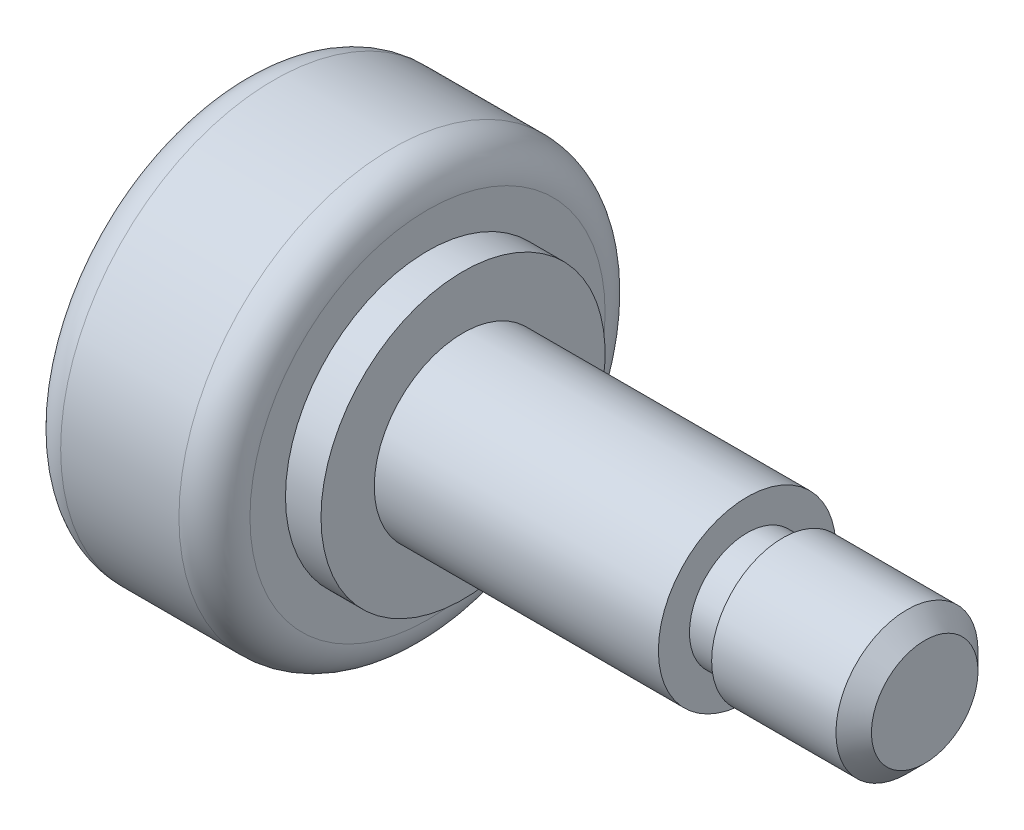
ISO-10303-21;
HEADER;
FILE_DESCRIPTION(('STEP AP214'),'2;1');
FILE_NAME('part.step','',(''),(''),'','','');
FILE_SCHEMA(('AUTOMOTIVE_DESIGN { 1 0 10303 214 1 1 1 1 }'));
ENDSEC;
DATA;
#1=APPLICATION_CONTEXT('core data for automotive mechanical design processes');
#2=APPLICATION_PROTOCOL_DEFINITION('international standard','automotive_design',2000,#1);
#3=PRODUCT_CONTEXT('',#1,'mechanical');
#4=PRODUCT('Part','Part','',(#3));
#5=PRODUCT_RELATED_PRODUCT_CATEGORY('part','',(#4));
#6=PRODUCT_DEFINITION_FORMATION('','',#4);
#7=PRODUCT_DEFINITION_CONTEXT('part definition',#1,'design');
#8=PRODUCT_DEFINITION('design','',#6,#7);
#9=PRODUCT_DEFINITION_SHAPE('','',#8);
#10=(LENGTH_UNIT() NAMED_UNIT(*) SI_UNIT(.MILLI.,.METRE.));
#11=(NAMED_UNIT(*) PLANE_ANGLE_UNIT() SI_UNIT($,.RADIAN.));
#12=(NAMED_UNIT(*) SI_UNIT($,.STERADIAN.) SOLID_ANGLE_UNIT());
#13=UNCERTAINTY_MEASURE_WITH_UNIT(LENGTH_MEASURE(1.E-05),#10,'distance_accuracy_value','');
#14=(GEOMETRIC_REPRESENTATION_CONTEXT(3) GLOBAL_UNCERTAINTY_ASSIGNED_CONTEXT((#13)) GLOBAL_UNIT_ASSIGNED_CONTEXT((#10,
#11,#12)) REPRESENTATION_CONTEXT('',''));
#15=CARTESIAN_POINT('',(0.,0.,0.));
#16=DIRECTION('',(0.,0.,1.));
#17=DIRECTION('',(1.,0.,0.));
#18=AXIS2_PLACEMENT_3D('',#15,#16,#17);
#19=CARTESIAN_POINT('',(40.,0.,0.));
#20=DIRECTION('',(-1.,0.,0.));
#21=DIRECTION('',(0.,1.,0.));
#22=AXIS2_PLACEMENT_3D('',#19,#20,#21);
#23=SPHERICAL_SURFACE('',#22,40.);
#24=CARTESIAN_POINT('',(1.4098888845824,0.,0.));
#25=DIRECTION('',(-1.,0.,0.));
#26=DIRECTION('',(0.,0.,1.));
#27=AXIS2_PLACEMENT_3D('',#24,#25,#26);
#28=CIRCLE('',#27,10.5263157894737);
#29=CARTESIAN_POINT('',(1.4098888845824,0.,10.5263157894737));
#30=VERTEX_POINT('',#29);
#31=EDGE_CURVE('E91',#30,#30,#28,.T.);
#32=ORIENTED_EDGE('',*,*,#31,.T.);
#33=EDGE_LOOP('',(#32));
#34=FACE_BOUND('',#33,.T.);
#35=ADVANCED_FACE('F46',(#34),#23,.T.);
#36=CARTESIAN_POINT('',(40.,0.,0.));
#37=DIRECTION('',(1.,0.,0.));
#38=DIRECTION('',(0.,0.,-1.));
#39=AXIS2_PLACEMENT_3D('',#36,#37,#38);
#40=PLANE('',#39);
#41=CARTESIAN_POINT('',(40.,0.,0.));
#42=DIRECTION('',(1.,0.,0.));
#43=DIRECTION('',(0.,0.,-1.));
#44=AXIS2_PLACEMENT_3D('',#41,#42,#43);
#45=CIRCLE('',#44,3.);
#46=CARTESIAN_POINT('',(40.,0.,-3.));
#47=VERTEX_POINT('',#46);
#48=EDGE_CURVE('E10',#47,#47,#45,.T.);
#49=ORIENTED_EDGE('',*,*,#48,.T.);
#50=EDGE_LOOP('',(#49));
#51=FACE_BOUND('',#50,.T.);
#52=ADVANCED_FACE('F111',(#51),#40,.T.);
#53=CARTESIAN_POINT('',(0.,0.,0.));
#54=DIRECTION('',(-1.,0.,0.));
#55=DIRECTION('',(0.,0.,1.));
#56=AXIS2_PLACEMENT_3D('',#53,#54,#55);
#57=CYLINDRICAL_SURFACE('',#56,4.);
#58=CARTESIAN_POINT('',(39.,0.,0.));
#59=DIRECTION('',(1.,0.,0.));
#60=DIRECTION('',(0.,0.,-1.));
#61=AXIS2_PLACEMENT_3D('',#58,#59,#60);
#62=CIRCLE('',#61,4.);
#63=CARTESIAN_POINT('',(39.,0.,-4.));
#64=VERTEX_POINT('',#63);
#65=EDGE_CURVE('E54',#64,#64,#62,.F.);
#66=ORIENTED_EDGE('',*,*,#65,.T.);
#67=EDGE_LOOP('',(#66));
#68=FACE_BOUND('',#67,.T.);
#69=CARTESIAN_POINT('',(32.,0.,0.));
#70=DIRECTION('',(-1.,0.,0.));
#71=DIRECTION('',(0.,0.,1.));
#72=AXIS2_PLACEMENT_3D('',#69,#70,#71);
#73=CIRCLE('',#72,4.);
#74=CARTESIAN_POINT('',(32.,0.,4.));
#75=VERTEX_POINT('',#74);
#76=EDGE_CURVE('E58',#75,#75,#73,.T.);
#77=ORIENTED_EDGE('',*,*,#76,.F.);
#78=EDGE_LOOP('',(#77));
#79=FACE_BOUND('',#78,.T.);
#80=ADVANCED_FACE('F115',(#68,#79),#57,.T.);
#81=CARTESIAN_POINT('',(32.,0.,0.));
#82=DIRECTION('',(1.,0.,0.));
#83=DIRECTION('',(0.,0.,-1.));
#84=AXIS2_PLACEMENT_3D('',#81,#82,#83);
#85=PLANE('',#84);
#86=CARTESIAN_POINT('',(32.,0.,0.));
#87=DIRECTION('',(-1.,0.,0.));
#88=DIRECTION('',(0.,0.,1.));
#89=AXIS2_PLACEMENT_3D('',#86,#87,#88);
#90=CIRCLE('',#89,3.25);
#91=CARTESIAN_POINT('',(32.,0.,3.25));
#92=VERTEX_POINT('',#91);
#93=EDGE_CURVE('E62',#92,#92,#90,.T.);
#94=ORIENTED_EDGE('',*,*,#93,.F.);
#95=EDGE_LOOP('',(#94));
#96=FACE_BOUND('',#95,.T.);
#97=ORIENTED_EDGE('',*,*,#76,.T.);
#98=EDGE_LOOP('',(#97));
#99=FACE_BOUND('',#98,.T.);
#100=ADVANCED_FACE('F120',(#96,#99),#85,.F.);
#101=CARTESIAN_POINT('',(0.,0.,0.));
#102=DIRECTION('',(-1.,0.,0.));
#103=DIRECTION('',(0.,0.,1.));
#104=AXIS2_PLACEMENT_3D('',#101,#102,#103);
#105=CYLINDRICAL_SURFACE('',#104,3.25);
#106=ORIENTED_EDGE('',*,*,#93,.T.);
#107=EDGE_LOOP('',(#106));
#108=FACE_BOUND('',#107,.T.);
#109=CARTESIAN_POINT('',(30.,0.,0.));
#110=DIRECTION('',(-1.,0.,0.));
#111=DIRECTION('',(0.,0.,1.));
#112=AXIS2_PLACEMENT_3D('',#109,#110,#111);
#113=CIRCLE('',#112,3.25);
#114=CARTESIAN_POINT('',(30.,0.,3.25));
#115=VERTEX_POINT('',#114);
#116=EDGE_CURVE('E67',#115,#115,#113,.T.);
#117=ORIENTED_EDGE('',*,*,#116,.F.);
#118=EDGE_LOOP('',(#117));
#119=FACE_BOUND('',#118,.T.);
#120=ADVANCED_FACE('F122',(#108,#119),#105,.T.);
#121=CARTESIAN_POINT('',(30.,0.,0.));
#122=DIRECTION('',(1.,0.,0.));
#123=DIRECTION('',(0.,0.,-1.));
#124=AXIS2_PLACEMENT_3D('',#121,#122,#123);
#125=PLANE('',#124);
#126=ORIENTED_EDGE('',*,*,#116,.T.);
#127=EDGE_LOOP('',(#126));
#128=FACE_BOUND('',#127,.T.);
#129=CARTESIAN_POINT('',(30.,0.,0.));
#130=DIRECTION('',(-1.,0.,0.));
#131=DIRECTION('',(0.,0.,1.));
#132=AXIS2_PLACEMENT_3D('',#129,#130,#131);
#133=CIRCLE('',#132,5.);
#134=CARTESIAN_POINT('',(30.,0.,5.));
#135=VERTEX_POINT('',#134);
#136=EDGE_CURVE('E70',#135,#135,#133,.T.);
#137=ORIENTED_EDGE('',*,*,#136,.F.);
#138=EDGE_LOOP('',(#137));
#139=FACE_BOUND('',#138,.T.);
#140=ADVANCED_FACE('F126',(#128,#139),#125,.T.);
#141=CARTESIAN_POINT('',(0.,0.,0.));
#142=DIRECTION('',(-1.,0.,0.));
#143=DIRECTION('',(0.,0.,1.));
#144=AXIS2_PLACEMENT_3D('',#141,#142,#143);
#145=CYLINDRICAL_SURFACE('',#144,5.);
#146=ORIENTED_EDGE('',*,*,#136,.T.);
#147=EDGE_LOOP('',(#146));
#148=FACE_BOUND('',#147,.T.);
#149=CARTESIAN_POINT('',(14.,0.,0.));
#150=DIRECTION('',(-1.,0.,0.));
#151=DIRECTION('',(0.,0.,1.));
#152=AXIS2_PLACEMENT_3D('',#149,#150,#151);
#153=CIRCLE('',#152,5.);
#154=CARTESIAN_POINT('',(14.,0.,5.));
#155=VERTEX_POINT('',#154);
#156=EDGE_CURVE('E73',#155,#155,#153,.T.);
#157=ORIENTED_EDGE('',*,*,#156,.F.);
#158=EDGE_LOOP('',(#157));
#159=FACE_BOUND('',#158,.T.);
#160=ADVANCED_FACE('F130',(#148,#159),#145,.T.);
#161=CARTESIAN_POINT('',(14.,0.,0.));
#162=DIRECTION('',(1.,0.,0.));
#163=DIRECTION('',(0.,0.,-1.));
#164=AXIS2_PLACEMENT_3D('',#161,#162,#163);
#165=PLANE('',#164);
#166=ORIENTED_EDGE('',*,*,#156,.T.);
#167=EDGE_LOOP('',(#166));
#168=FACE_BOUND('',#167,.T.);
#169=CARTESIAN_POINT('',(14.,0.,0.));
#170=DIRECTION('',(-1.,0.,0.));
#171=DIRECTION('',(0.,0.,1.));
#172=AXIS2_PLACEMENT_3D('',#169,#170,#171);
#173=CIRCLE('',#172,8.);
#174=CARTESIAN_POINT('',(14.,0.,8.));
#175=VERTEX_POINT('',#174);
#176=EDGE_CURVE('E76',#175,#175,#173,.T.);
#177=ORIENTED_EDGE('',*,*,#176,.F.);
#178=EDGE_LOOP('',(#177));
#179=FACE_BOUND('',#178,.T.);
#180=ADVANCED_FACE('F134',(#168,#179),#165,.T.);
#181=CARTESIAN_POINT('',(0.,0.,0.));
#182=DIRECTION('',(-1.,0.,0.));
#183=DIRECTION('',(0.,0.,1.));
#184=AXIS2_PLACEMENT_3D('',#181,#182,#183);
#185=CYLINDRICAL_SURFACE('',#184,8.);
#186=CARTESIAN_POINT('',(12.,0.,0.));
#187=DIRECTION('',(-1.,0.,0.));
#188=DIRECTION('',(0.,0.,1.));
#189=AXIS2_PLACEMENT_3D('',#186,#187,#188);
#190=CIRCLE('',#189,8.);
#191=CARTESIAN_POINT('',(12.,0.,8.));
#192=VERTEX_POINT('',#191);
#193=EDGE_CURVE('E79',#192,#192,#190,.T.);
#194=ORIENTED_EDGE('',*,*,#193,.F.);
#195=EDGE_LOOP('',(#194));
#196=FACE_BOUND('',#195,.T.);
#197=ORIENTED_EDGE('',*,*,#176,.T.);
#198=EDGE_LOOP('',(#197));
#199=FACE_BOUND('',#198,.T.);
#200=ADVANCED_FACE('F138',(#196,#199),#185,.T.);
#201=CARTESIAN_POINT('',(12.,0.,0.));
#202=DIRECTION('',(1.,0.,0.));
#203=DIRECTION('',(0.,0.,-1.));
#204=AXIS2_PLACEMENT_3D('',#201,#202,#203);
#205=PLANE('',#204);
#206=ORIENTED_EDGE('',*,*,#193,.T.);
#207=EDGE_LOOP('',(#206));
#208=FACE_BOUND('',#207,.T.);
#209=CARTESIAN_POINT('',(12.,0.,0.));
#210=DIRECTION('',(-1.,0.,0.));
#211=DIRECTION('',(0.,0.,1.));
#212=AXIS2_PLACEMENT_3D('',#209,#210,#211);
#213=CIRCLE('',#212,9.99999999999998);
#214=CARTESIAN_POINT('',(12.,0.,9.99999999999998));
#215=VERTEX_POINT('',#214);
#216=EDGE_CURVE('E82',#215,#215,#213,.T.);
#217=ORIENTED_EDGE('',*,*,#216,.F.);
#218=EDGE_LOOP('',(#217));
#219=FACE_BOUND('',#218,.T.);
#220=ADVANCED_FACE('F142',(#208,#219),#205,.T.);
#221=CARTESIAN_POINT('',(10.,0.,0.));
#222=DIRECTION('',(-1.,0.,0.));
#223=DIRECTION('',(0.,0.,1.));
#224=AXIS2_PLACEMENT_3D('',#221,#222,#223);
#225=TOROIDAL_SURFACE('',#224,9.99999999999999,2.);
#226=CARTESIAN_POINT('',(9.99999999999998,0.,0.));
#227=DIRECTION('',(-1.,0.,0.));
#228=DIRECTION('',(0.,0.,1.));
#229=AXIS2_PLACEMENT_3D('',#226,#227,#228);
#230=CIRCLE('',#229,12.);
#231=CARTESIAN_POINT('',(9.99999999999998,0.,12.));
#232=VERTEX_POINT('',#231);
#233=EDGE_CURVE('E85',#232,#232,#230,.T.);
#234=ORIENTED_EDGE('',*,*,#233,.F.);
#235=EDGE_LOOP('',(#234));
#236=FACE_BOUND('',#235,.T.);
#237=ORIENTED_EDGE('',*,*,#216,.T.);
#238=EDGE_LOOP('',(#237));
#239=FACE_BOUND('',#238,.T.);
#240=ADVANCED_FACE('F107',(#236,#239),#225,.T.);
#241=CARTESIAN_POINT('',(0.,0.,0.));
#242=DIRECTION('',(-1.,0.,0.));
#243=DIRECTION('',(0.,0.,1.));
#244=AXIS2_PLACEMENT_3D('',#241,#242,#243);
#245=CYLINDRICAL_SURFACE('',#244,12.);
#246=CARTESIAN_POINT('',(3.33939444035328,0.,0.));
#247=DIRECTION('',(-1.,0.,0.));
#248=DIRECTION('',(0.,0.,1.));
#249=AXIS2_PLACEMENT_3D('',#246,#247,#248);
#250=CIRCLE('',#249,12.);
#251=CARTESIAN_POINT('',(3.33939444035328,0.,12.));
#252=VERTEX_POINT('',#251);
#253=EDGE_CURVE('E88',#252,#252,#250,.T.);
#254=ORIENTED_EDGE('',*,*,#253,.F.);
#255=EDGE_LOOP('',(#254));
#256=FACE_BOUND('',#255,.T.);
#257=ORIENTED_EDGE('',*,*,#233,.T.);
#258=EDGE_LOOP('',(#257));
#259=FACE_BOUND('',#258,.T.);
#260=ADVANCED_FACE('F98',(#256,#259),#245,.T.);
#261=CARTESIAN_POINT('',(3.33939444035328,0.,0.));
#262=DIRECTION('',(-1.,0.,0.));
#263=DIRECTION('',(0.,0.,1.));
#264=AXIS2_PLACEMENT_3D('',#261,#262,#263);
#265=TOROIDAL_SURFACE('',#264,9.99999999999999,2.);
#266=ORIENTED_EDGE('',*,*,#253,.T.);
#267=EDGE_LOOP('',(#266));
#268=FACE_BOUND('',#267,.T.);
#269=ORIENTED_EDGE('',*,*,#31,.F.);
#270=EDGE_LOOP('',(#269));
#271=FACE_BOUND('',#270,.T.);
#272=ADVANCED_FACE('F96',(#268,#271),#265,.T.);
#273=CARTESIAN_POINT('',(39.,0.,0.));
#274=DIRECTION('',(-1.,0.,0.));
#275=DIRECTION('',(0.,0.,1.));
#276=AXIS2_PLACEMENT_3D('',#273,#274,#275);
#277=CONICAL_SURFACE('',#276,4.,0.78539816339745);
#278=ORIENTED_EDGE('',*,*,#48,.F.);
#279=EDGE_LOOP('',(#278));
#280=FACE_BOUND('',#279,.T.);
#281=ORIENTED_EDGE('',*,*,#65,.F.);
#282=EDGE_LOOP('',(#281));
#283=FACE_BOUND('',#282,.T.);
#284=ADVANCED_FACE('F49',(#280,#283),#277,.T.);
#285=CLOSED_SHELL('',(#35,#52,#80,#100,#120,#140,#160,#180,#200,#220,#240,#260,#272,#284));
#286=MANIFOLD_SOLID_BREP('B2',#285);
#287=ADVANCED_BREP_SHAPE_REPRESENTATION('',(#18,#286),#14);
#288=SHAPE_DEFINITION_REPRESENTATION(#9,#287);
ENDSEC;
END-ISO-10303-21;
